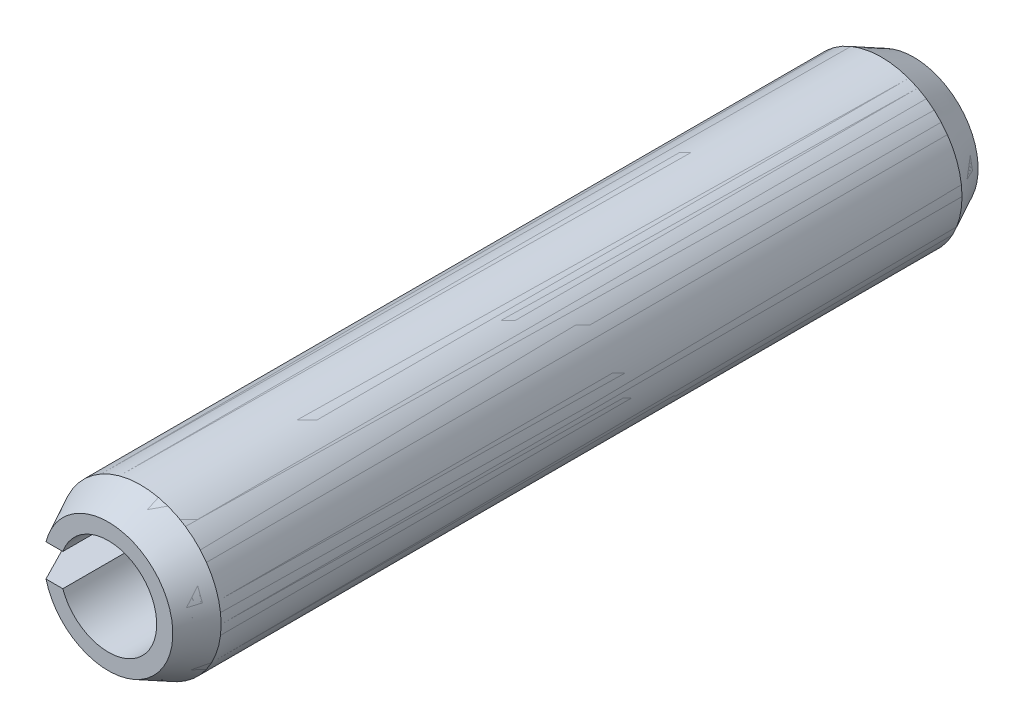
ISO-10303-21;
HEADER;
FILE_DESCRIPTION(('STEP AP214'),'2;1');
FILE_NAME('part.step','',(''),(''),'','','');
FILE_SCHEMA(('AUTOMOTIVE_DESIGN { 1 0 10303 214 1 1 1 1 }'));
ENDSEC;
DATA;
#1=APPLICATION_CONTEXT('core data for automotive mechanical design processes');
#2=APPLICATION_PROTOCOL_DEFINITION('international standard','automotive_design',2000,#1);
#3=PRODUCT_CONTEXT('',#1,'mechanical');
#4=PRODUCT('Part','Part','',(#3));
#5=PRODUCT_RELATED_PRODUCT_CATEGORY('part','',(#4));
#6=PRODUCT_DEFINITION_FORMATION('','',#4);
#7=PRODUCT_DEFINITION_CONTEXT('part definition',#1,'design');
#8=PRODUCT_DEFINITION('design','',#6,#7);
#9=PRODUCT_DEFINITION_SHAPE('','',#8);
#10=(LENGTH_UNIT() NAMED_UNIT(*) SI_UNIT(.MILLI.,.METRE.));
#11=(NAMED_UNIT(*) PLANE_ANGLE_UNIT() SI_UNIT($,.RADIAN.));
#12=(NAMED_UNIT(*) SI_UNIT($,.STERADIAN.) SOLID_ANGLE_UNIT());
#13=UNCERTAINTY_MEASURE_WITH_UNIT(LENGTH_MEASURE(1.E-05),#10,'distance_accuracy_value','');
#14=(GEOMETRIC_REPRESENTATION_CONTEXT(3) GLOBAL_UNCERTAINTY_ASSIGNED_CONTEXT((#13)) GLOBAL_UNIT_ASSIGNED_CONTEXT((#10,
#11,#12)) REPRESENTATION_CONTEXT('',''));
#15=CARTESIAN_POINT('',(0.,0.,0.));
#16=DIRECTION('',(0.,0.,1.));
#17=DIRECTION('',(1.,0.,0.));
#18=AXIS2_PLACEMENT_3D('',#15,#16,#17);
#19=CARTESIAN_POINT('',(0.,0.,50.));
#20=DIRECTION('',(0.,0.,-1.));
#21=DIRECTION('',(-1.,0.,0.));
#22=AXIS2_PLACEMENT_3D('',#19,#20,#21);
#23=CONICAL_SURFACE('',#22,4.,0.463647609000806);
#24=CARTESIAN_POINT('',(0.,0.,48.));
#25=DIRECTION('',(0.,0.,-1.));
#26=DIRECTION('',(-1.,0.,0.));
#27=AXIS2_PLACEMENT_3D('',#24,#25,#26);
#28=CIRCLE('',#27,5.);
#29=CARTESIAN_POINT('',(-4.89897948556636,0.999999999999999,48.));
#30=VERTEX_POINT('',#29);
#31=CARTESIAN_POINT('',(-4.89897948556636,-0.999999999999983,48.));
#32=VERTEX_POINT('',#31);
#33=EDGE_CURVE('P0_E152',#30,#32,#28,.T.);
#34=ORIENTED_EDGE('',*,*,#33,.F.);
#35=CARTESIAN_POINT('',(-7.19920685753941,1.00000000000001,43.4633457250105));
#36=CARTESIAN_POINT('',(-6.96576856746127,1.00000000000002,43.9257530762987));
#37=CARTESIAN_POINT('',(-6.73218105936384,1.00000000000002,44.3880853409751));
#38=CARTESIAN_POINT('',(-6.26454193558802,1.00000000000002,45.3124995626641));
#39=CARTESIAN_POINT('',(-6.03049033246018,1.00000000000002,45.7745815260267));
#40=CARTESIAN_POINT('',(-5.56177509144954,1.00000000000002,46.6983602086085));
#41=CARTESIAN_POINT('',(-5.32711153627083,1.00000000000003,47.160056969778));
#42=CARTESIAN_POINT('',(-4.85683817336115,1.00000000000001,48.0829845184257));
#43=CARTESIAN_POINT('',(-4.62122834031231,0.999999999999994,48.5442152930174));
#44=CARTESIAN_POINT('',(-4.26668268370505,1.00000000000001,49.2355487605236));
#45=CARTESIAN_POINT('',(-4.14829859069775,1.00000000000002,49.4659343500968));
#46=CARTESIAN_POINT('',(-3.91105336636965,1.00000000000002,49.926458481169));
#47=CARTESIAN_POINT('',(-3.79219223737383,1.00000000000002,50.1565970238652));
#48=CARTESIAN_POINT('',(-3.55385298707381,1.00000000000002,50.6165345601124));
#49=CARTESIAN_POINT('',(-3.43437490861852,1.00000000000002,50.846333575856));
#50=CARTESIAN_POINT('',(-3.19457347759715,1.00000000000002,51.305495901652));
#51=CARTESIAN_POINT('',(-3.07425010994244,1.00000000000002,51.5348592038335));
#52=CARTESIAN_POINT('',(-2.83239517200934,1.00000000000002,51.9930185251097));
#53=CARTESIAN_POINT('',(-2.71086331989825,1.00000000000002,52.2218143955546));
#54=CARTESIAN_POINT('',(-2.46609199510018,1.00000000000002,52.6784799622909));
#55=CARTESIAN_POINT('',(-2.3428526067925,1.00000000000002,52.9063497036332));
#56=CARTESIAN_POINT('',(-2.15596872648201,1.00000000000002,53.2470833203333));
#57=CARTESIAN_POINT('',(-2.09332833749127,1.00000000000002,53.3604974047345));
#58=CARTESIAN_POINT('',(-1.96717538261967,1.00000000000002,53.5868365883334));
#59=CARTESIAN_POINT('',(-1.90366283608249,1.00000000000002,53.6997616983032));
#60=CARTESIAN_POINT('',(-1.77549442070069,1.00000000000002,53.9249895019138));
#61=CARTESIAN_POINT('',(-1.71083835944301,1.00000000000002,54.0372920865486));
#62=CARTESIAN_POINT('',(-1.57993262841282,1.00000000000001,54.2609746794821));
#63=CARTESIAN_POINT('',(-1.51368283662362,1.00000000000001,54.3723546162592));
#64=CARTESIAN_POINT('',(-1.44641069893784,0.99999999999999,54.4831241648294));
#65=B_SPLINE_CURVE_WITH_KNOTS('',3,(#35,#36,#37,#38,#39,#40,#41,#42,#43,#44,#45,#46,#47,#48,#49,
#50,#51,#52,#53,#54,#55,#56,#57,#58,#59,#60,#61,#62,#63,#64),.UNSPECIFIED.,.F.,.F.,(4,2,2,2,2,2,
2,2,2,2,2,2,2,2,4),(0.,1.55397133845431,3.1079012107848,4.66163095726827,6.21540255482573,
6.99246767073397,7.76952900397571,8.54653707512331,9.3235590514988,10.1007666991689,
10.8779360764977,11.2666220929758,11.6552995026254,12.044042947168,12.4328162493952),.UNSPECIFIED.);
#66=CARTESIAN_POINT('',(-3.87298334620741,0.999999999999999,50.));
#67=VERTEX_POINT('',#66);
#68=EDGE_CURVE('P0_E44',#30,#67,#65,.T.);
#69=ORIENTED_EDGE('',*,*,#68,.T.);
#70=CARTESIAN_POINT('',(0.,0.,50.));
#71=DIRECTION('',(0.,0.,-1.));
#72=DIRECTION('',(-1.,0.,0.));
#73=AXIS2_PLACEMENT_3D('',#70,#71,#72);
#74=CIRCLE('',#73,4.);
#75=CARTESIAN_POINT('',(-3.87298334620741,-1.,50.));
#76=VERTEX_POINT('',#75);
#77=EDGE_CURVE('P0_E133',#67,#76,#74,.T.);
#78=ORIENTED_EDGE('',*,*,#77,.T.);
#79=CARTESIAN_POINT('',(-1.44641069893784,-1.00000000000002,54.4831241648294));
#80=CARTESIAN_POINT('',(-1.499039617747,-0.999999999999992,54.3965019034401));
#81=CARTESIAN_POINT('',(-1.5510259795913,-0.999999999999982,54.3094939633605));
#82=CARTESIAN_POINT('',(-1.65395647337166,-0.999999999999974,54.134869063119));
#83=CARTESIAN_POINT('',(-1.70490065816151,-0.999999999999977,54.0472521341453));
#84=CARTESIAN_POINT('',(-1.80598802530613,-0.999999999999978,53.8715748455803));
#85=CARTESIAN_POINT('',(-1.85613131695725,-0.999999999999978,53.7835145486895));
#86=CARTESIAN_POINT('',(-1.95578026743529,-0.999999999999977,53.6070325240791));
#87=CARTESIAN_POINT('',(-2.00528591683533,-0.999999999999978,53.5186107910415));
#88=CARTESIAN_POINT('',(-2.15301103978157,-0.999999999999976,53.2529638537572));
#89=CARTESIAN_POINT('',(-2.25046400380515,-0.999999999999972,53.0753125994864));
#90=CARTESIAN_POINT('',(-2.44397565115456,-0.999999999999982,52.7192449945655));
#91=CARTESIAN_POINT('',(-2.54003427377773,-0.999999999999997,52.540828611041));
#92=CARTESIAN_POINT('',(-2.78434813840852,-1.00000000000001,52.0839919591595));
#93=CARTESIAN_POINT('',(-2.93189222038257,-0.999999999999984,51.8051916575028));
#94=CARTESIAN_POINT('',(-3.22544724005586,-0.999999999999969,51.2467846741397));
#95=CARTESIAN_POINT('',(-3.37145816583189,-0.999999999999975,50.9671779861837));
#96=CARTESIAN_POINT('',(-3.66245685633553,-0.999999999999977,50.4073701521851));
#97=CARTESIAN_POINT('',(-3.80744443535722,-0.999999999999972,50.1271689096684));
#98=CARTESIAN_POINT('',(-4.09667321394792,-0.999999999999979,49.5663813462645));
#99=CARTESIAN_POINT('',(-4.24091441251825,-0.99999999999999,49.2857950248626));
#100=CARTESIAN_POINT('',(-4.6212860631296,-0.999999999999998,48.544102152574));
#101=CARTESIAN_POINT('',(-4.85695365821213,-0.99999999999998,48.0827583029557));
#102=CARTESIAN_POINT('',(-5.32734831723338,-0.999999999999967,47.159591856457));
#103=CARTESIAN_POINT('',(-5.56207538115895,-0.999999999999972,46.6977692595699));
#104=CARTESIAN_POINT('',(-6.0307964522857,-0.999999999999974,45.7739773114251));
#105=CARTESIAN_POINT('',(-6.26479070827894,-0.999999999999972,45.3120080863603));
#106=CARTESIAN_POINT('',(-6.73230865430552,-0.999999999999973,44.387832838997));
#107=CARTESIAN_POINT('',(-6.96583234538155,-0.999999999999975,43.925626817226));
#108=CARTESIAN_POINT('',(-7.19920685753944,-0.999999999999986,43.4633457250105));
#109=B_SPLINE_CURVE_WITH_KNOTS('',3,(#79,#80,#81,#82,#83,#84,#85,#86,#87,#88,#89,#90,#91,#92,
#93,#94,#95,#96,#97,#98,#99,#100,#101,#102,#103,#104,#105,#106,#107,#108),.UNSPECIFIED.,.F.,.F.,
(4,2,2,2,2,2,2,2,2,2,2,2,2,2,4),(0.,0.304062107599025,0.608108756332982,0.9121135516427,
1.21612283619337,1.82398831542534,2.43188017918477,3.37817456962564,4.32447631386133,
5.27094558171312,6.21741611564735,7.77156868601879,9.32572127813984,10.8792716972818,
12.4328186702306),.UNSPECIFIED.);
#110=EDGE_CURVE('P0_E113',#76,#32,#109,.T.);
#111=ORIENTED_EDGE('',*,*,#110,.T.);
#112=EDGE_LOOP('',(#34,#69,#78,#111));
#113=FACE_BOUND('',#112,.T.);
#114=ADVANCED_FACE('P0_F24',(#113),#23,.T.);
#115=CARTESIAN_POINT('',(0.,0.,0.));
#116=DIRECTION('',(0.,0.,-1.));
#117=DIRECTION('',(-1.,0.,0.));
#118=AXIS2_PLACEMENT_3D('',#115,#116,#117);
#119=CYLINDRICAL_SURFACE('',#118,5.);
#120=CARTESIAN_POINT('',(0.,0.,1.99999999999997));
#121=DIRECTION('',(0.,0.,-1.));
#122=DIRECTION('',(-1.,0.,0.));
#123=AXIS2_PLACEMENT_3D('',#120,#121,#122);
#124=CIRCLE('',#123,5.);
#125=CARTESIAN_POINT('',(-4.89897948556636,1.,2.));
#126=VERTEX_POINT('',#125);
#127=CARTESIAN_POINT('',(-4.89897948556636,-1.,2.));
#128=VERTEX_POINT('',#127);
#129=EDGE_CURVE('P0_E149',#126,#128,#124,.T.);
#130=ORIENTED_EDGE('',*,*,#129,.F.);
#131=DIRECTION('',(0.,0.,-1.));
#132=VECTOR('',#131,1.);
#133=CARTESIAN_POINT('',(-4.89897948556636,0.999999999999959,0.));
#134=LINE('',#133,#132);
#135=EDGE_CURVE('P0_E48',#126,#30,#134,.F.);
#136=ORIENTED_EDGE('',*,*,#135,.T.);
#137=ORIENTED_EDGE('',*,*,#33,.T.);
#138=DIRECTION('',(0.,0.,-1.));
#139=VECTOR('',#138,1.);
#140=CARTESIAN_POINT('',(-4.89897948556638,-1.00000000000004,0.));
#141=LINE('',#140,#139);
#142=EDGE_CURVE('P0_E94',#32,#128,#141,.T.);
#143=ORIENTED_EDGE('',*,*,#142,.T.);
#144=EDGE_LOOP('',(#130,#136,#137,#143));
#145=FACE_BOUND('',#144,.T.);
#146=ADVANCED_FACE('P0_F138',(#145),#119,.T.);
#147=CARTESIAN_POINT('',(0.,0.,1.99999999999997));
#148=DIRECTION('',(0.,0.,1.));
#149=DIRECTION('',(1.,0.,0.));
#150=AXIS2_PLACEMENT_3D('',#147,#148,#149);
#151=CONICAL_SURFACE('',#150,5.,0.463647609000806);
#152=CARTESIAN_POINT('',(0.,0.,0.));
#153=DIRECTION('',(0.,0.,-1.));
#154=DIRECTION('',(-1.,0.,0.));
#155=AXIS2_PLACEMENT_3D('',#152,#153,#154);
#156=CIRCLE('',#155,4.);
#157=CARTESIAN_POINT('',(-3.87298334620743,0.999999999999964,0.));
#158=VERTEX_POINT('',#157);
#159=CARTESIAN_POINT('',(-3.87298334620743,-1.00000000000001,0.));
#160=VERTEX_POINT('',#159);
#161=EDGE_CURVE('P0_E153',#158,#160,#156,.T.);
#162=ORIENTED_EDGE('',*,*,#161,.F.);
#163=CARTESIAN_POINT('',(-1.44641069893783,0.99999999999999,-4.48312416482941));
#164=CARTESIAN_POINT('',(-1.49903961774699,1.00000000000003,-4.39650190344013));
#165=CARTESIAN_POINT('',(-1.55102597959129,1.00000000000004,-4.30949396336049));
#166=CARTESIAN_POINT('',(-1.65395647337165,1.00000000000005,-4.13486906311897));
#167=CARTESIAN_POINT('',(-1.70490065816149,1.00000000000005,-4.04725213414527));
#168=CARTESIAN_POINT('',(-1.80598802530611,1.00000000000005,-3.87157484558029));
#169=CARTESIAN_POINT('',(-1.85613131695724,1.00000000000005,-3.78351454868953));
#170=CARTESIAN_POINT('',(-1.95578026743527,1.00000000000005,-3.60703252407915));
#171=CARTESIAN_POINT('',(-2.00528591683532,1.00000000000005,-3.51861079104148));
#172=CARTESIAN_POINT('',(-2.15301103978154,1.00000000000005,-3.25296385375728));
#173=CARTESIAN_POINT('',(-2.25046400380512,1.00000000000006,-3.07531259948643));
#174=CARTESIAN_POINT('',(-2.44397565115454,1.00000000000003,-2.71924499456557));
#175=CARTESIAN_POINT('',(-2.54003427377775,0.99999999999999,-2.54082861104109));
#176=CARTESIAN_POINT('',(-2.78434813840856,0.999999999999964,-2.08399195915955));
#177=CARTESIAN_POINT('',(-2.93189222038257,1.00000000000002,-1.80519165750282));
#178=CARTESIAN_POINT('',(-3.22544724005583,1.00000000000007,-1.24678467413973));
#179=CARTESIAN_POINT('',(-3.37145816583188,1.00000000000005,-0.967177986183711));
#180=CARTESIAN_POINT('',(-3.66245685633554,1.00000000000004,-0.407370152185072));
#181=CARTESIAN_POINT('',(-3.80744443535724,1.00000000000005,-0.127168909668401));
#182=CARTESIAN_POINT('',(-4.09667321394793,1.00000000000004,0.433618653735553));
#183=CARTESIAN_POINT('',(-4.24091441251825,1.00000000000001,0.714204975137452));
#184=CARTESIAN_POINT('',(-4.6212860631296,0.999999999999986,1.455897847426));
#185=CARTESIAN_POINT('',(-4.85695365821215,1.00000000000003,1.91724169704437));
#186=CARTESIAN_POINT('',(-5.32734831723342,1.00000000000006,2.84040814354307));
#187=CARTESIAN_POINT('',(-5.56207538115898,1.00000000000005,3.30223074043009));
#188=CARTESIAN_POINT('',(-6.03079645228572,1.00000000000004,4.22602268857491));
#189=CARTESIAN_POINT('',(-6.26479070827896,1.00000000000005,4.6879919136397));
#190=CARTESIAN_POINT('',(-6.73230865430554,1.00000000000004,5.61216716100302));
#191=CARTESIAN_POINT('',(-6.96583234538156,1.00000000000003,6.074373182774));
#192=CARTESIAN_POINT('',(-7.19920685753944,0.999999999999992,6.53665427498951));
#193=B_SPLINE_CURVE_WITH_KNOTS('',3,(#163,#164,#165,#166,#167,#168,#169,#170,#171,#172,#173,
#174,#175,#176,#177,#178,#179,#180,#181,#182,#183,#184,#185,#186,#187,#188,#189,#190,#191,#192),
.UNSPECIFIED.,.F.,.F.,(4,2,2,2,2,2,2,2,2,2,2,2,2,2,4),(0.,0.304062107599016,0.608108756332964,
0.912113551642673,1.21612283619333,1.82398831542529,2.4318801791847,3.37817456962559,
4.32447631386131,5.27094558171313,6.21741611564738,7.77156868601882,9.32572127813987,
10.8792716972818,12.4328186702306),.UNSPECIFIED.);
#194=EDGE_CURVE('P0_E11',#158,#126,#193,.T.);
#195=ORIENTED_EDGE('',*,*,#194,.T.);
#196=ORIENTED_EDGE('',*,*,#129,.T.);
#197=CARTESIAN_POINT('',(-7.19920685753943,-1.00000000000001,6.53665427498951));
#198=CARTESIAN_POINT('',(-6.9657685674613,-0.999999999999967,6.07424692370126));
#199=CARTESIAN_POINT('',(-6.73218105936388,-0.999999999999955,5.61191465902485));
#200=CARTESIAN_POINT('',(-6.26454193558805,-0.99999999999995,4.68750043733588));
#201=CARTESIAN_POINT('',(-6.03049033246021,-0.999999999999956,4.22541847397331));
#202=CARTESIAN_POINT('',(-5.56177509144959,-0.999999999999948,3.30163979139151));
#203=CARTESIAN_POINT('',(-5.32711153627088,-0.999999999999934,2.83994303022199));
#204=CARTESIAN_POINT('',(-4.85683817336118,-0.999999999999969,1.91701548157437));
#205=CARTESIAN_POINT('',(-4.62122834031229,-1.00000000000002,1.45578470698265));
#206=CARTESIAN_POINT('',(-4.26668268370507,-0.999999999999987,0.764451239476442));
#207=CARTESIAN_POINT('',(-4.14829859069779,-0.99999999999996,0.534065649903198));
#208=CARTESIAN_POINT('',(-3.91105336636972,-0.99999999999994,0.0735415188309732));
#209=CARTESIAN_POINT('',(-3.79219223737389,-0.999999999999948,-0.156597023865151));
#210=CARTESIAN_POINT('',(-3.55385298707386,-0.999999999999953,-0.616534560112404));
#211=CARTESIAN_POINT('',(-3.43437490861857,-0.999999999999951,-0.846333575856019));
#212=CARTESIAN_POINT('',(-3.19457347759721,-0.999999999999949,-1.30549590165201));
#213=CARTESIAN_POINT('',(-3.07425010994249,-0.999999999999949,-1.53485920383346));
#214=CARTESIAN_POINT('',(-2.8323951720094,-0.999999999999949,-1.9930185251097));
#215=CARTESIAN_POINT('',(-2.71086331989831,-0.999999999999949,-2.22181439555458));
#216=CARTESIAN_POINT('',(-2.46609199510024,-0.999999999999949,-2.67847996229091));
#217=CARTESIAN_POINT('',(-2.34285260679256,-0.999999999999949,-2.90634970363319));
#218=CARTESIAN_POINT('',(-2.15596872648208,-0.999999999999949,-3.24708332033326));
#219=CARTESIAN_POINT('',(-2.09332833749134,-0.999999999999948,-3.3604974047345));
#220=CARTESIAN_POINT('',(-1.96717538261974,-0.999999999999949,-3.58683658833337));
#221=CARTESIAN_POINT('',(-1.90366283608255,-0.99999999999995,-3.69976169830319));
#222=CARTESIAN_POINT('',(-1.77549442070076,-0.999999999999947,-3.92498950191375));
#223=CARTESIAN_POINT('',(-1.71083835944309,-0.999999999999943,-4.03729208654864));
#224=CARTESIAN_POINT('',(-1.57993262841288,-0.999999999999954,-4.26097467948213));
#225=CARTESIAN_POINT('',(-1.51368283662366,-0.999999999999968,-4.37235461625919));
#226=CARTESIAN_POINT('',(-1.44641069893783,-1.,-4.48312416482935));
#227=B_SPLINE_CURVE_WITH_KNOTS('',3,(#197,#198,#199,#200,#201,#202,#203,#204,#205,#206,#207,
#208,#209,#210,#211,#212,#213,#214,#215,#216,#217,#218,#219,#220,#221,#222,#223,#224,#225,#226),
.UNSPECIFIED.,.F.,.F.,(4,2,2,2,2,2,2,2,2,2,2,2,2,2,4),(0.,1.55397133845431,3.10790121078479,
4.66163095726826,6.2154025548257,6.99246767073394,7.76952900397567,8.54653707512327,
9.32355905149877,10.1007666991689,10.8779360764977,11.2666220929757,11.6552995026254,
12.044042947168,12.4328162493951),.UNSPECIFIED.);
#228=EDGE_CURVE('P0_E37',#128,#160,#227,.T.);
#229=ORIENTED_EDGE('',*,*,#228,.T.);
#230=EDGE_LOOP('',(#162,#195,#196,#229));
#231=FACE_BOUND('',#230,.T.);
#232=ADVANCED_FACE('P0_F135',(#231),#151,.T.);
#233=CARTESIAN_POINT('',(-6.00000000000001,1.00000000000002,50.));
#234=DIRECTION('',(0.,0.999999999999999,0.));
#235=DIRECTION('',(0.,0.,-1.));
#236=AXIS2_PLACEMENT_3D('',#233,#234,#235);
#237=PLANE('',#236);
#238=ORIENTED_EDGE('',*,*,#194,.F.);
#239=DIRECTION('',(1.,0.,0.));
#240=VECTOR('',#239,1.);
#241=CARTESIAN_POINT('',(-3.87298334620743,0.999999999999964,0.));
#242=LINE('',#241,#240);
#243=CARTESIAN_POINT('',(-2.82842712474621,0.999999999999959,0.));
#244=VERTEX_POINT('',#243);
#245=EDGE_CURVE('P0_E78',#158,#244,#242,.T.);
#246=ORIENTED_EDGE('',*,*,#245,.T.);
#247=DIRECTION('',(0.,0.,-1.));
#248=VECTOR('',#247,1.);
#249=CARTESIAN_POINT('',(-2.82842712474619,1.,50.));
#250=LINE('',#249,#248);
#251=CARTESIAN_POINT('',(-2.82842712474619,1.,50.));
#252=VERTEX_POINT('',#251);
#253=EDGE_CURVE('P0_E81',#252,#244,#250,.T.);
#254=ORIENTED_EDGE('',*,*,#253,.F.);
#255=DIRECTION('',(1.,0.,0.));
#256=VECTOR('',#255,1.);
#257=CARTESIAN_POINT('',(-3.87298334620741,0.999999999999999,50.));
#258=LINE('',#257,#256);
#259=EDGE_CURVE('P0_E102',#67,#252,#258,.T.);
#260=ORIENTED_EDGE('',*,*,#259,.F.);
#261=ORIENTED_EDGE('',*,*,#68,.F.);
#262=ORIENTED_EDGE('',*,*,#135,.F.);
#263=EDGE_LOOP('',(#238,#246,#254,#260,#261,#262));
#264=FACE_BOUND('',#263,.T.);
#265=ADVANCED_FACE('P0_F80',(#264),#237,.F.);
#266=CARTESIAN_POINT('',(0.,-0.999999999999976,50.));
#267=DIRECTION('',(0.,-0.999999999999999,0.));
#268=DIRECTION('',(0.,0.,1.));
#269=AXIS2_PLACEMENT_3D('',#266,#267,#268);
#270=PLANE('',#269);
#271=ORIENTED_EDGE('',*,*,#110,.F.);
#272=DIRECTION('',(-1.,0.,0.));
#273=VECTOR('',#272,1.);
#274=CARTESIAN_POINT('',(-2.82842712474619,-0.999999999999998,50.));
#275=LINE('',#274,#273);
#276=CARTESIAN_POINT('',(-2.82842712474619,-0.999999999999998,50.));
#277=VERTEX_POINT('',#276);
#278=EDGE_CURVE('P0_E107',#277,#76,#275,.T.);
#279=ORIENTED_EDGE('',*,*,#278,.F.);
#280=DIRECTION('',(0.,0.,-1.));
#281=VECTOR('',#280,1.);
#282=CARTESIAN_POINT('',(-2.82842712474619,-0.999999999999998,50.));
#283=LINE('',#282,#281);
#284=CARTESIAN_POINT('',(-2.82842712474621,-1.00000000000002,0.));
#285=VERTEX_POINT('',#284);
#286=EDGE_CURVE('P0_E95',#277,#285,#283,.T.);
#287=ORIENTED_EDGE('',*,*,#286,.T.);
#288=DIRECTION('',(-1.,0.,0.));
#289=VECTOR('',#288,1.);
#290=CARTESIAN_POINT('',(-2.82842712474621,-1.00000000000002,0.));
#291=LINE('',#290,#289);
#292=EDGE_CURVE('P0_E100',#285,#160,#291,.T.);
#293=ORIENTED_EDGE('',*,*,#292,.T.);
#294=ORIENTED_EDGE('',*,*,#228,.F.);
#295=ORIENTED_EDGE('',*,*,#142,.F.);
#296=EDGE_LOOP('',(#271,#279,#287,#293,#294,#295));
#297=FACE_BOUND('',#296,.T.);
#298=ADVANCED_FACE('P0_F121',(#297),#270,.F.);
#299=CARTESIAN_POINT('',(0.,0.,50.));
#300=DIRECTION('',(0.,0.,-1.));
#301=DIRECTION('',(-1.,0.,0.));
#302=AXIS2_PLACEMENT_3D('',#299,#300,#301);
#303=CYLINDRICAL_SURFACE('',#302,3.);
#304=CARTESIAN_POINT('',(0.,0.,0.));
#305=DIRECTION('',(0.,0.,-1.));
#306=DIRECTION('',(1.,0.,0.));
#307=AXIS2_PLACEMENT_3D('',#304,#305,#306);
#308=CIRCLE('',#307,3.);
#309=EDGE_CURVE('P0_E87',#244,#285,#308,.T.);
#310=ORIENTED_EDGE('',*,*,#309,.T.);
#311=ORIENTED_EDGE('',*,*,#286,.F.);
#312=CARTESIAN_POINT('',(0.,0.,50.));
#313=DIRECTION('',(0.,0.,-1.));
#314=DIRECTION('',(1.,0.,0.));
#315=AXIS2_PLACEMENT_3D('',#312,#313,#314);
#316=CIRCLE('',#315,3.);
#317=EDGE_CURVE('P0_E93',#252,#277,#316,.T.);
#318=ORIENTED_EDGE('',*,*,#317,.F.);
#319=ORIENTED_EDGE('',*,*,#253,.T.);
#320=EDGE_LOOP('',(#310,#311,#318,#319));
#321=FACE_BOUND('',#320,.T.);
#322=ADVANCED_FACE('P0_F90',(#321),#303,.F.);
#323=CARTESIAN_POINT('',(0.,0.,50.));
#324=DIRECTION('',(0.,0.,1.));
#325=DIRECTION('',(1.,0.,0.));
#326=AXIS2_PLACEMENT_3D('',#323,#324,#325);
#327=PLANE('',#326);
#328=ORIENTED_EDGE('',*,*,#77,.F.);
#329=ORIENTED_EDGE('',*,*,#259,.T.);
#330=ORIENTED_EDGE('',*,*,#317,.T.);
#331=ORIENTED_EDGE('',*,*,#278,.T.);
#332=EDGE_LOOP('',(#328,#329,#330,#331));
#333=FACE_BOUND('',#332,.T.);
#334=ADVANCED_FACE('P0_F162',(#333),#327,.T.);
#335=CARTESIAN_POINT('',(0.,0.,0.));
#336=DIRECTION('',(0.,0.,1.));
#337=DIRECTION('',(1.,0.,0.));
#338=AXIS2_PLACEMENT_3D('',#335,#336,#337);
#339=PLANE('',#338);
#340=ORIENTED_EDGE('',*,*,#161,.T.);
#341=ORIENTED_EDGE('',*,*,#292,.F.);
#342=ORIENTED_EDGE('',*,*,#309,.F.);
#343=ORIENTED_EDGE('',*,*,#245,.F.);
#344=EDGE_LOOP('',(#340,#341,#342,#343));
#345=FACE_BOUND('',#344,.T.);
#346=ADVANCED_FACE('P0_F98',(#345),#339,.F.);
#347=CLOSED_SHELL('',(#114,#146,#232,#265,#298,#322,#334,#346));
#348=MANIFOLD_SOLID_BREP('P0_B2',#347);
#349=CARTESIAN_POINT('',(0.,0.,50.));
#350=DIRECTION('',(0.,0.,-1.));
#351=DIRECTION('',(-1.,0.,0.));
#352=AXIS2_PLACEMENT_3D('',#349,#350,#351);
#353=CONICAL_SURFACE('',#352,4.,0.463647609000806);
#354=CARTESIAN_POINT('',(0.,0.,48.));
#355=DIRECTION('',(0.,0.,-1.));
#356=DIRECTION('',(-1.,0.,0.));
#357=AXIS2_PLACEMENT_3D('',#354,#355,#356);
#358=CIRCLE('',#357,5.);
#359=CARTESIAN_POINT('',(-4.89897948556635,1.,48.));
#360=VERTEX_POINT('',#359);
#361=CARTESIAN_POINT('',(-4.89897948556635,-1.,48.));
#362=VERTEX_POINT('',#361);
#363=EDGE_CURVE('P1_E71',#360,#362,#358,.T.);
#364=ORIENTED_EDGE('',*,*,#363,.F.);
#365=CARTESIAN_POINT('',(-7.19920685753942,1.,43.4633457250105));
#366=CARTESIAN_POINT('',(-6.96576856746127,1.,43.9257530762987));
#367=CARTESIAN_POINT('',(-6.73218105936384,1.,44.3880853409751));
#368=CARTESIAN_POINT('',(-6.26454193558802,1.,45.3124995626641));
#369=CARTESIAN_POINT('',(-6.03049033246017,1.,45.7745815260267));
#370=CARTESIAN_POINT('',(-5.56177509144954,1.,46.6983602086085));
#371=CARTESIAN_POINT('',(-5.32711153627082,1.,47.160056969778));
#372=CARTESIAN_POINT('',(-4.85683817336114,1.,48.0829845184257));
#373=CARTESIAN_POINT('',(-4.6212283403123,1.,48.5442152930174));
#374=CARTESIAN_POINT('',(-4.26668268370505,1.,49.2355487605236));
#375=CARTESIAN_POINT('',(-4.14829859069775,1.,49.4659343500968));
#376=CARTESIAN_POINT('',(-3.91105336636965,1.,49.926458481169));
#377=CARTESIAN_POINT('',(-3.79219223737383,1.,50.1565970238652));
#378=CARTESIAN_POINT('',(-3.55385298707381,1.,50.6165345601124));
#379=CARTESIAN_POINT('',(-3.43437490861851,1.,50.846333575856));
#380=CARTESIAN_POINT('',(-3.19457347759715,1.,51.305495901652));
#381=CARTESIAN_POINT('',(-3.07425010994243,1.,51.5348592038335));
#382=CARTESIAN_POINT('',(-2.83239517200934,1.,51.9930185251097));
#383=CARTESIAN_POINT('',(-2.71086331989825,1.,52.2218143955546));
#384=CARTESIAN_POINT('',(-2.46609199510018,1.,52.6784799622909));
#385=CARTESIAN_POINT('',(-2.3428526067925,1.,52.9063497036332));
#386=CARTESIAN_POINT('',(-2.15596872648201,1.,53.2470833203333));
#387=CARTESIAN_POINT('',(-2.09332833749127,1.,53.3604974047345));
#388=CARTESIAN_POINT('',(-1.96717538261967,1.,53.5868365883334));
#389=CARTESIAN_POINT('',(-1.90366283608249,1.,53.6997616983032));
#390=CARTESIAN_POINT('',(-1.77549442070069,1.,53.9249895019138));
#391=CARTESIAN_POINT('',(-1.71083835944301,1.,54.0372920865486));
#392=CARTESIAN_POINT('',(-1.57993262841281,1.,54.2609746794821));
#393=CARTESIAN_POINT('',(-1.51368283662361,1.,54.3723546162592));
#394=CARTESIAN_POINT('',(-1.44641069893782,1.,54.4831241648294));
#395=B_SPLINE_CURVE_WITH_KNOTS('',3,(#365,#366,#367,#368,#369,#370,#371,#372,#373,#374,#375,
#376,#377,#378,#379,#380,#381,#382,#383,#384,#385,#386,#387,#388,#389,#390,#391,#392,#393,#394),
.UNSPECIFIED.,.F.,.F.,(4,2,2,2,2,2,2,2,2,2,2,2,2,2,4),(0.,1.55397133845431,3.1079012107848,
4.66163095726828,6.21540255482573,6.99246767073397,7.76952900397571,8.54653707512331,
9.3235590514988,10.1007666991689,10.8779360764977,11.2666220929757,11.6552995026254,
12.044042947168,12.4328162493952),.UNSPECIFIED.);
#396=CARTESIAN_POINT('',(-3.87298334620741,1.,50.));
#397=VERTEX_POINT('',#396);
#398=EDGE_CURVE('P1_E37',#360,#397,#395,.T.);
#399=ORIENTED_EDGE('',*,*,#398,.T.);
#400=CARTESIAN_POINT('',(0.,0.,50.));
#401=DIRECTION('',(0.,0.,-1.));
#402=DIRECTION('',(-1.,0.,0.));
#403=AXIS2_PLACEMENT_3D('',#400,#401,#402);
#404=CIRCLE('',#403,4.);
#405=CARTESIAN_POINT('',(-3.87298334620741,-1.,50.));
#406=VERTEX_POINT('',#405);
#407=EDGE_CURVE('P1_E57',#397,#406,#404,.T.);
#408=ORIENTED_EDGE('',*,*,#407,.T.);
#409=CARTESIAN_POINT('',(-1.44641069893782,-1.,54.4831241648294));
#410=CARTESIAN_POINT('',(-1.49903961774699,-1.,54.3965019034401));
#411=CARTESIAN_POINT('',(-1.55102597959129,-1.,54.3094939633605));
#412=CARTESIAN_POINT('',(-1.65395647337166,-1.,54.134869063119));
#413=CARTESIAN_POINT('',(-1.7049006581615,-1.,54.0472521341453));
#414=CARTESIAN_POINT('',(-1.80598802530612,-1.,53.8715748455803));
#415=CARTESIAN_POINT('',(-1.85613131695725,-1.,53.7835145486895));
#416=CARTESIAN_POINT('',(-1.95578026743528,-1.,53.6070325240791));
#417=CARTESIAN_POINT('',(-2.00528591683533,-1.,53.5186107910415));
#418=CARTESIAN_POINT('',(-2.15301103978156,-1.,53.2529638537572));
#419=CARTESIAN_POINT('',(-2.25046400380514,-1.,53.0753125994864));
#420=CARTESIAN_POINT('',(-2.44397565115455,-1.,52.7192449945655));
#421=CARTESIAN_POINT('',(-2.54003427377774,-1.,52.540828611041));
#422=CARTESIAN_POINT('',(-2.78434813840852,-1.,52.0839919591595));
#423=CARTESIAN_POINT('',(-2.93189222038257,-1.,51.8051916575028));
#424=CARTESIAN_POINT('',(-3.22544724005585,-1.,51.2467846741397));
#425=CARTESIAN_POINT('',(-3.37145816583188,-1.,50.9671779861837));
#426=CARTESIAN_POINT('',(-3.66245685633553,-1.,50.4073701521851));
#427=CARTESIAN_POINT('',(-3.80744443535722,-1.,50.1271689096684));
#428=CARTESIAN_POINT('',(-4.09667321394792,-1.,49.5663813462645));
#429=CARTESIAN_POINT('',(-4.24091441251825,-1.,49.2857950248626));
#430=CARTESIAN_POINT('',(-4.62128606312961,-1.,48.544102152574));
#431=CARTESIAN_POINT('',(-4.85695365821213,-1.,48.0827583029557));
#432=CARTESIAN_POINT('',(-5.32734831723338,-1.,47.1595918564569));
#433=CARTESIAN_POINT('',(-5.56207538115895,-1.,46.6977692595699));
#434=CARTESIAN_POINT('',(-6.0307964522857,-1.,45.7739773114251));
#435=CARTESIAN_POINT('',(-6.26479070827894,-1.,45.3120080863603));
#436=CARTESIAN_POINT('',(-6.73230865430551,-1.,44.387832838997));
#437=CARTESIAN_POINT('',(-6.96583234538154,-1.,43.925626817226));
#438=CARTESIAN_POINT('',(-7.19920685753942,-1.,43.4633457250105));
#439=B_SPLINE_CURVE_WITH_KNOTS('',3,(#409,#410,#411,#412,#413,#414,#415,#416,#417,#418,#419,
#420,#421,#422,#423,#424,#425,#426,#427,#428,#429,#430,#431,#432,#433,#434,#435,#436,#437,#438),
.UNSPECIFIED.,.F.,.F.,(4,2,2,2,2,2,2,2,2,2,2,2,2,2,4),(0.,0.304062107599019,0.608108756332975,
0.912113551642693,1.21612283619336,1.82398831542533,2.43188017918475,3.37817456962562,
4.32447631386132,5.27094558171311,6.21741611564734,7.77156868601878,9.32572127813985,
10.8792716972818,12.4328186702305),.UNSPECIFIED.);
#440=EDGE_CURVE('P1_E100',#406,#362,#439,.T.);
#441=ORIENTED_EDGE('',*,*,#440,.T.);
#442=EDGE_LOOP('',(#364,#399,#408,#441));
#443=FACE_BOUND('',#442,.T.);
#444=ADVANCED_FACE('P1_F15',(#443),#353,.T.);
#445=CARTESIAN_POINT('',(0.,0.,0.));
#446=DIRECTION('',(0.,0.,-1.));
#447=DIRECTION('',(-1.,0.,0.));
#448=AXIS2_PLACEMENT_3D('',#445,#446,#447);
#449=CYLINDRICAL_SURFACE('',#448,5.);
#450=CARTESIAN_POINT('',(0.,0.,2.));
#451=DIRECTION('',(0.,0.,-1.));
#452=DIRECTION('',(-1.,0.,0.));
#453=AXIS2_PLACEMENT_3D('',#450,#451,#452);
#454=CIRCLE('',#453,5.);
#455=CARTESIAN_POINT('',(-4.89897948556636,1.,2.));
#456=VERTEX_POINT('',#455);
#457=CARTESIAN_POINT('',(-4.89897948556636,-1.,2.));
#458=VERTEX_POINT('',#457);
#459=EDGE_CURVE('P1_E69',#456,#458,#454,.T.);
#460=ORIENTED_EDGE('',*,*,#459,.F.);
#461=DIRECTION('',(0.,0.,-1.));
#462=VECTOR('',#461,1.);
#463=CARTESIAN_POINT('',(-4.89897948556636,1.,0.));
#464=LINE('',#463,#462);
#465=EDGE_CURVE('P1_E62',#456,#360,#464,.F.);
#466=ORIENTED_EDGE('',*,*,#465,.T.);
#467=ORIENTED_EDGE('',*,*,#363,.T.);
#468=DIRECTION('',(0.,0.,-1.));
#469=VECTOR('',#468,1.);
#470=CARTESIAN_POINT('',(-4.89897948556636,-1.,0.));
#471=LINE('',#470,#469);
#472=EDGE_CURVE('P1_E58',#362,#458,#471,.T.);
#473=ORIENTED_EDGE('',*,*,#472,.T.);
#474=EDGE_LOOP('',(#460,#466,#467,#473));
#475=FACE_BOUND('',#474,.T.);
#476=ADVANCED_FACE('P1_F108',(#475),#449,.T.);
#477=CARTESIAN_POINT('',(0.,0.,2.));
#478=DIRECTION('',(0.,0.,1.));
#479=DIRECTION('',(1.,0.,0.));
#480=AXIS2_PLACEMENT_3D('',#477,#478,#479);
#481=CONICAL_SURFACE('',#480,5.,0.463647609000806);
#482=CARTESIAN_POINT('',(0.,0.,0.));
#483=DIRECTION('',(0.,0.,-1.));
#484=DIRECTION('',(-1.,0.,0.));
#485=AXIS2_PLACEMENT_3D('',#482,#483,#484);
#486=CIRCLE('',#485,4.);
#487=CARTESIAN_POINT('',(-3.87298334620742,1.,0.));
#488=VERTEX_POINT('',#487);
#489=CARTESIAN_POINT('',(-3.87298334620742,-1.,0.));
#490=VERTEX_POINT('',#489);
#491=EDGE_CURVE('P1_E30',#488,#490,#486,.T.);
#492=ORIENTED_EDGE('',*,*,#491,.F.);
#493=CARTESIAN_POINT('',(-1.44641069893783,1.,-4.48312416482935));
#494=CARTESIAN_POINT('',(-1.49903961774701,1.,-4.39650190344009));
#495=CARTESIAN_POINT('',(-1.55102597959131,1.,-4.30949396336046));
#496=CARTESIAN_POINT('',(-1.65395647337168,1.,-4.13486906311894));
#497=CARTESIAN_POINT('',(-1.70490065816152,1.,-4.04725213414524));
#498=CARTESIAN_POINT('',(-1.80598802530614,1.,-3.87157484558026));
#499=CARTESIAN_POINT('',(-1.85613131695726,1.,-3.7835145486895));
#500=CARTESIAN_POINT('',(-1.95578026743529,1.,-3.60703252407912));
#501=CARTESIAN_POINT('',(-2.00528591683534,1.,-3.51861079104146));
#502=CARTESIAN_POINT('',(-2.15301103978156,1.,-3.25296385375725));
#503=CARTESIAN_POINT('',(-2.25046400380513,1.,-3.07531259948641));
#504=CARTESIAN_POINT('',(-2.44397565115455,1.,-2.71924499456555));
#505=CARTESIAN_POINT('',(-2.54003427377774,1.,-2.54082861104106));
#506=CARTESIAN_POINT('',(-2.78434813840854,1.,-2.08399195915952));
#507=CARTESIAN_POINT('',(-2.93189222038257,1.,-1.8051916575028));
#508=CARTESIAN_POINT('',(-3.22544724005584,1.,-1.24678467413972));
#509=CARTESIAN_POINT('',(-3.37145816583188,1.,-0.967177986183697));
#510=CARTESIAN_POINT('',(-3.66245685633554,1.,-0.407370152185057));
#511=CARTESIAN_POINT('',(-3.80744443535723,1.,-0.127168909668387));
#512=CARTESIAN_POINT('',(-4.09667321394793,1.,0.433618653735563));
#513=CARTESIAN_POINT('',(-4.24091441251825,1.,0.714204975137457));
#514=CARTESIAN_POINT('',(-4.6212860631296,1.,1.455897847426));
#515=CARTESIAN_POINT('',(-4.85695365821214,1.,1.91724169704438));
#516=CARTESIAN_POINT('',(-5.32734831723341,1.,2.84040814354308));
#517=CARTESIAN_POINT('',(-5.56207538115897,1.,3.3022307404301));
#518=CARTESIAN_POINT('',(-6.03079645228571,1.,4.22602268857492));
#519=CARTESIAN_POINT('',(-6.26479070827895,1.,4.6879919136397));
#520=CARTESIAN_POINT('',(-6.73230865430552,1.,5.61216716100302));
#521=CARTESIAN_POINT('',(-6.96583234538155,1.,6.07437318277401));
#522=CARTESIAN_POINT('',(-7.19920685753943,1.,6.53665427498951));
#523=B_SPLINE_CURVE_WITH_KNOTS('',3,(#493,#494,#495,#496,#497,#498,#499,#500,#501,#502,#503,
#504,#505,#506,#507,#508,#509,#510,#511,#512,#513,#514,#515,#516,#517,#518,#519,#520,#521,#522),
.UNSPECIFIED.,.F.,.F.,(4,2,2,2,2,2,2,2,2,2,2,2,2,2,4),(0.,0.304062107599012,0.608108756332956,
0.912113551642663,1.21612283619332,1.82398831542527,2.43188017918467,3.37817456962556,
4.32447631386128,5.27094558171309,6.21741611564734,7.77156868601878,9.32572127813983,
10.8792716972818,12.4328186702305),.UNSPECIFIED.);
#524=EDGE_CURVE('P1_E23',#488,#456,#523,.T.);
#525=ORIENTED_EDGE('',*,*,#524,.T.);
#526=ORIENTED_EDGE('',*,*,#459,.T.);
#527=CARTESIAN_POINT('',(-7.19920685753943,-1.,6.53665427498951));
#528=CARTESIAN_POINT('',(-6.96576856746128,-1.,6.07424692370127));
#529=CARTESIAN_POINT('',(-6.73218105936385,-1.,5.61191465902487));
#530=CARTESIAN_POINT('',(-6.26454193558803,-1.,4.6875004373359));
#531=CARTESIAN_POINT('',(-6.03049033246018,-1.,4.22541847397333));
#532=CARTESIAN_POINT('',(-5.56177509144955,-1.,3.30163979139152));
#533=CARTESIAN_POINT('',(-5.32711153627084,-1.,2.83994303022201));
#534=CARTESIAN_POINT('',(-4.85683817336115,-1.,1.91701548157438));
#535=CARTESIAN_POINT('',(-4.62122834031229,-1.,1.45578470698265));
#536=CARTESIAN_POINT('',(-4.26668268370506,-1.,0.764451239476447));
#537=CARTESIAN_POINT('',(-4.14829859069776,-1.,0.534065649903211));
#538=CARTESIAN_POINT('',(-3.91105336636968,-1.,0.0735415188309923));
#539=CARTESIAN_POINT('',(-3.79219223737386,-1.,-0.156597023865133));
#540=CARTESIAN_POINT('',(-3.55385298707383,-1.,-0.616534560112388));
#541=CARTESIAN_POINT('',(-3.43437490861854,-1.,-0.846333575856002));
#542=CARTESIAN_POINT('',(-3.19457347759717,-1.,-1.30549590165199));
#543=CARTESIAN_POINT('',(-3.07425010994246,-1.,-1.53485920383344));
#544=CARTESIAN_POINT('',(-2.83239517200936,-1.,-1.99301852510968));
#545=CARTESIAN_POINT('',(-2.71086331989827,-1.,-2.22181439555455));
#546=CARTESIAN_POINT('',(-2.4660919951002,-1.,-2.67847996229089));
#547=CARTESIAN_POINT('',(-2.34285260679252,-1.,-2.90634970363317));
#548=CARTESIAN_POINT('',(-2.15596872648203,-1.,-3.24708332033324));
#549=CARTESIAN_POINT('',(-2.09332833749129,-1.,-3.36049740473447));
#550=CARTESIAN_POINT('',(-1.96717538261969,-1.,-3.58683658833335));
#551=CARTESIAN_POINT('',(-1.90366283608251,-1.,-3.69976169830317));
#552=CARTESIAN_POINT('',(-1.77549442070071,-1.,-3.92498950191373));
#553=CARTESIAN_POINT('',(-1.71083835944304,-1.,-4.03729208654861));
#554=CARTESIAN_POINT('',(-1.57993262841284,-1.,-4.2609746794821));
#555=CARTESIAN_POINT('',(-1.51368283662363,-1.,-4.37235461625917));
#556=CARTESIAN_POINT('',(-1.44641069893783,-1.,-4.48312416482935));
#557=B_SPLINE_CURVE_WITH_KNOTS('',3,(#527,#528,#529,#530,#531,#532,#533,#534,#535,#536,#537,
#538,#539,#540,#541,#542,#543,#544,#545,#546,#547,#548,#549,#550,#551,#552,#553,#554,#555,#556),
.UNSPECIFIED.,.F.,.F.,(4,2,2,2,2,2,2,2,2,2,2,2,2,2,4),(0.,1.55397133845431,3.10790121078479,
4.66163095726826,6.2154025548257,6.99246767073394,7.76952900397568,8.54653707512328,
9.32355905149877,10.1007666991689,10.8779360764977,11.2666220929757,11.6552995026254,
12.044042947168,12.4328162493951),.UNSPECIFIED.);
#558=EDGE_CURVE('P1_E66',#458,#490,#557,.T.);
#559=ORIENTED_EDGE('',*,*,#558,.T.);
#560=EDGE_LOOP('',(#492,#525,#526,#559));
#561=FACE_BOUND('',#560,.T.);
#562=ADVANCED_FACE('P1_F68',(#561),#481,.T.);
#563=CARTESIAN_POINT('',(-6.,1.,50.));
#564=DIRECTION('',(0.,1.,0.));
#565=DIRECTION('',(0.,0.,-1.));
#566=AXIS2_PLACEMENT_3D('',#563,#564,#565);
#567=PLANE('',#566);
#568=ORIENTED_EDGE('',*,*,#524,.F.);
#569=DIRECTION('',(0.,0.,1.));
#570=VECTOR('',#569,1.);
#571=CARTESIAN_POINT('',(-3.87298334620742,1.,0.));
#572=LINE('',#571,#570);
#573=EDGE_CURVE('P1_E53',#488,#397,#572,.T.);
#574=ORIENTED_EDGE('',*,*,#573,.T.);
#575=ORIENTED_EDGE('',*,*,#398,.F.);
#576=ORIENTED_EDGE('',*,*,#465,.F.);
#577=EDGE_LOOP('',(#568,#574,#575,#576));
#578=FACE_BOUND('',#577,.T.);
#579=ADVANCED_FACE('P1_F61',(#578),#567,.F.);
#580=CARTESIAN_POINT('',(0.,-1.,50.));
#581=DIRECTION('',(0.,-1.,0.));
#582=DIRECTION('',(0.,0.,1.));
#583=AXIS2_PLACEMENT_3D('',#580,#581,#582);
#584=PLANE('',#583);
#585=ORIENTED_EDGE('',*,*,#440,.F.);
#586=DIRECTION('',(0.,0.,1.));
#587=VECTOR('',#586,1.);
#588=CARTESIAN_POINT('',(-3.87298334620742,-1.,0.));
#589=LINE('',#588,#587);
#590=EDGE_CURVE('P1_E10',#406,#490,#589,.F.);
#591=ORIENTED_EDGE('',*,*,#590,.T.);
#592=ORIENTED_EDGE('',*,*,#558,.F.);
#593=ORIENTED_EDGE('',*,*,#472,.F.);
#594=EDGE_LOOP('',(#585,#591,#592,#593));
#595=FACE_BOUND('',#594,.T.);
#596=ADVANCED_FACE('P1_F92',(#595),#584,.F.);
#597=CARTESIAN_POINT('',(0.,0.,0.));
#598=DIRECTION('',(0.,0.,1.));
#599=DIRECTION('',(0.,-1.,0.));
#600=AXIS2_PLACEMENT_3D('',#597,#598,#599);
#601=CYLINDRICAL_SURFACE('',#600,4.);
#602=ORIENTED_EDGE('',*,*,#491,.T.);
#603=ORIENTED_EDGE('',*,*,#590,.F.);
#604=ORIENTED_EDGE('',*,*,#407,.F.);
#605=ORIENTED_EDGE('',*,*,#573,.F.);
#606=EDGE_LOOP('',(#602,#603,#604,#605));
#607=FACE_BOUND('',#606,.T.);
#608=ADVANCED_FACE('P1_F55',(#607),#601,.F.);
#609=CLOSED_SHELL('',(#444,#476,#562,#579,#596,#608));
#610=MANIFOLD_SOLID_BREP('P1_B1',#609);
#611=ADVANCED_BREP_SHAPE_REPRESENTATION('',(#18,#348,#610),#14);
#612=SHAPE_DEFINITION_REPRESENTATION(#9,#611);
ENDSEC;
END-ISO-10303-21;
